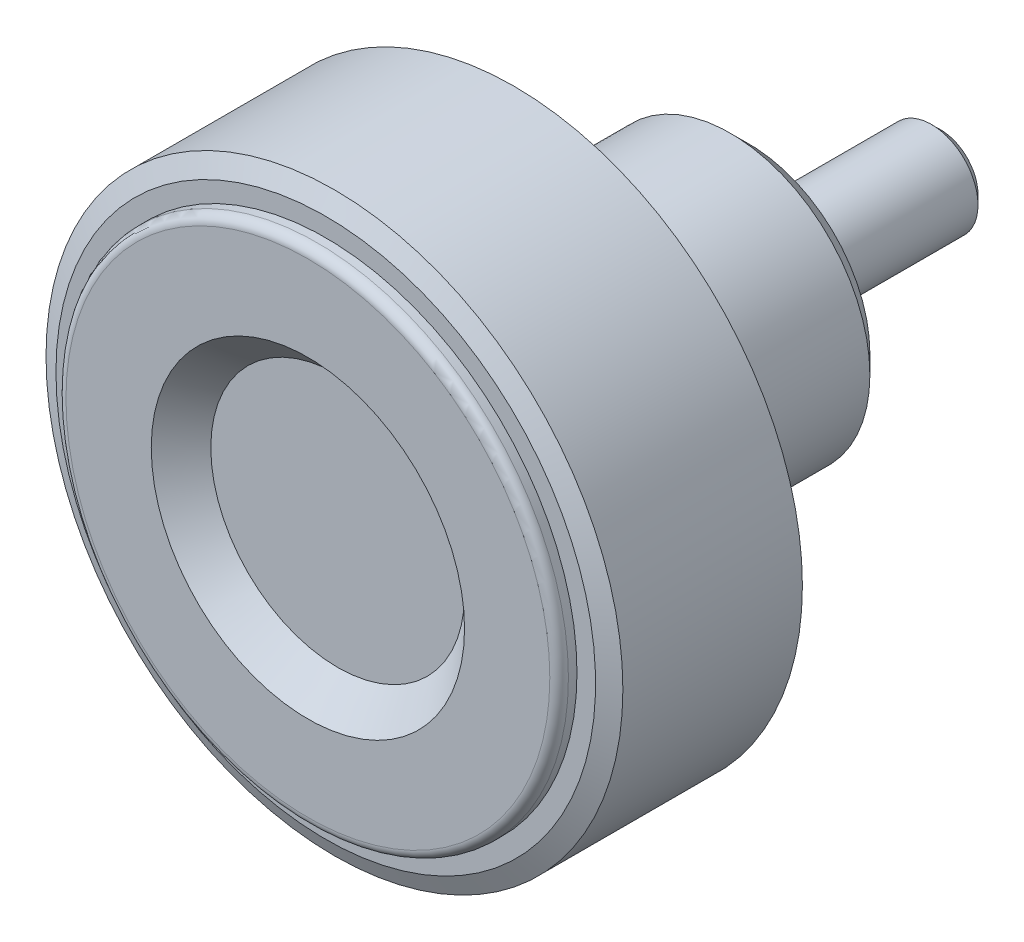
ISO-10303-21;
HEADER;
FILE_DESCRIPTION(('STEP AP214'),'2;1');
FILE_NAME('part.step','',(''),(''),'','','');
FILE_SCHEMA(('AUTOMOTIVE_DESIGN { 1 0 10303 214 1 1 1 1 }'));
ENDSEC;
DATA;
#1=APPLICATION_CONTEXT('core data for automotive mechanical design processes');
#2=APPLICATION_PROTOCOL_DEFINITION('international standard','automotive_design',2000,#1);
#3=PRODUCT_CONTEXT('',#1,'mechanical');
#4=PRODUCT('Part','Part','',(#3));
#5=PRODUCT_RELATED_PRODUCT_CATEGORY('part','',(#4));
#6=PRODUCT_DEFINITION_FORMATION('','',#4);
#7=PRODUCT_DEFINITION_CONTEXT('part definition',#1,'design');
#8=PRODUCT_DEFINITION('design','',#6,#7);
#9=PRODUCT_DEFINITION_SHAPE('','',#8);
#10=(LENGTH_UNIT() NAMED_UNIT(*) SI_UNIT(.MILLI.,.METRE.));
#11=(NAMED_UNIT(*) PLANE_ANGLE_UNIT() SI_UNIT($,.RADIAN.));
#12=(NAMED_UNIT(*) SI_UNIT($,.STERADIAN.) SOLID_ANGLE_UNIT());
#13=UNCERTAINTY_MEASURE_WITH_UNIT(LENGTH_MEASURE(1.E-05),#10,'distance_accuracy_value','');
#14=(GEOMETRIC_REPRESENTATION_CONTEXT(3) GLOBAL_UNCERTAINTY_ASSIGNED_CONTEXT((#13)) GLOBAL_UNIT_ASSIGNED_CONTEXT((#10,
#11,#12)) REPRESENTATION_CONTEXT('',''));
#15=CARTESIAN_POINT('',(0.,0.,0.));
#16=DIRECTION('',(0.,0.,1.));
#17=DIRECTION('',(1.,0.,0.));
#18=AXIS2_PLACEMENT_3D('',#15,#16,#17);
#19=CARTESIAN_POINT('',(0.,0.,0.));
#20=DIRECTION('',(0.,0.,-1.));
#21=DIRECTION('',(-1.,0.,0.));
#22=AXIS2_PLACEMENT_3D('',#19,#20,#21);
#23=CYLINDRICAL_SURFACE('',#22,15.5);
#24=CARTESIAN_POINT('',(0.,0.,22.573692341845));
#25=DIRECTION('',(0.,0.,-1.));
#26=DIRECTION('',(-1.,0.,0.));
#27=AXIS2_PLACEMENT_3D('',#24,#25,#26);
#28=CIRCLE('',#27,15.5);
#29=CARTESIAN_POINT('',(-15.5,0.,22.573692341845));
#30=VERTEX_POINT('',#29);
#31=EDGE_CURVE('E164',#30,#30,#28,.T.);
#32=ORIENTED_EDGE('',*,*,#31,.T.);
#33=EDGE_LOOP('',(#32));
#34=FACE_BOUND('',#33,.T.);
#35=CARTESIAN_POINT('',(0.,0.,12.926307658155));
#36=DIRECTION('',(0.,0.,1.));
#37=DIRECTION('',(0.,1.,0.));
#38=AXIS2_PLACEMENT_3D('',#35,#36,#37);
#39=CIRCLE('',#38,15.5);
#40=CARTESIAN_POINT('',(0.,15.5,12.926307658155));
#41=VERTEX_POINT('',#40);
#42=EDGE_CURVE('E160',#41,#41,#39,.F.);
#43=ORIENTED_EDGE('',*,*,#42,.F.);
#44=EDGE_LOOP('',(#43));
#45=FACE_BOUND('',#44,.T.);
#46=ADVANCED_FACE('F14',(#34,#45),#23,.T.);
#47=CARTESIAN_POINT('',(0.,0.,12.926307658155));
#48=DIRECTION('',(0.,0.,1.));
#49=DIRECTION('',(1.,0.,0.));
#50=AXIS2_PLACEMENT_3D('',#47,#48,#49);
#51=CONICAL_SURFACE('',#50,15.5,1.13446401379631);
#52=CARTESIAN_POINT('',(0.,0.,12.46));
#53=DIRECTION('',(0.,0.,1.));
#54=DIRECTION('',(1.,0.,0.));
#55=AXIS2_PLACEMENT_3D('',#52,#53,#54);
#56=CIRCLE('',#55,14.5);
#57=CARTESIAN_POINT('',(14.5,0.,12.46));
#58=VERTEX_POINT('',#57);
#59=EDGE_CURVE('E157',#58,#58,#56,.F.);
#60=ORIENTED_EDGE('',*,*,#59,.F.);
#61=EDGE_LOOP('',(#60));
#62=FACE_BOUND('',#61,.T.);
#63=ORIENTED_EDGE('',*,*,#42,.T.);
#64=EDGE_LOOP('',(#63));
#65=FACE_BOUND('',#64,.T.);
#66=ADVANCED_FACE('F457',(#62,#65),#51,.T.);
#67=CARTESIAN_POINT('',(0.,14.,12.46));
#68=DIRECTION('',(0.,0.,-1.));
#69=DIRECTION('',(-1.,0.,0.));
#70=AXIS2_PLACEMENT_3D('',#67,#68,#69);
#71=PLANE('',#70);
#72=ORIENTED_EDGE('',*,*,#59,.T.);
#73=EDGE_LOOP('',(#72));
#74=FACE_BOUND('',#73,.T.);
#75=CARTESIAN_POINT('',(0.,0.,12.46));
#76=DIRECTION('',(0.,0.,1.));
#77=DIRECTION('',(1.,0.,0.));
#78=AXIS2_PLACEMENT_3D('',#75,#76,#77);
#79=CIRCLE('',#78,13.5);
#80=CARTESIAN_POINT('',(13.5,0.,12.46));
#81=VERTEX_POINT('',#80);
#82=EDGE_CURVE('E154',#81,#81,#79,.F.);
#83=ORIENTED_EDGE('',*,*,#82,.F.);
#84=EDGE_LOOP('',(#83));
#85=FACE_BOUND('',#84,.T.);
#86=ADVANCED_FACE('F453',(#74,#85),#71,.T.);
#87=CARTESIAN_POINT('',(0.,1.00475,-10.));
#88=DIRECTION('',(0.,0.,-1.));
#89=DIRECTION('',(-1.,0.,0.));
#90=AXIS2_PLACEMENT_3D('',#87,#88,#89);
#91=PLANE('',#90);
#92=CARTESIAN_POINT('',(0.,0.,-10.0000000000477));
#93=DIRECTION('',(0.,0.,1.));
#94=DIRECTION('',(1.,0.,0.));
#95=AXIS2_PLACEMENT_3D('',#92,#93,#94);
#96=CIRCLE('',#95,2.00949999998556);
#97=CARTESIAN_POINT('',(2.00949999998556,0.,-10.0000000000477));
#98=VERTEX_POINT('',#97);
#99=EDGE_CURVE('E150',#98,#98,#96,.T.);
#100=ORIENTED_EDGE('',*,*,#99,.F.);
#101=EDGE_LOOP('',(#100));
#102=FACE_BOUND('',#101,.T.);
#103=ADVANCED_FACE('F449',(#102),#91,.T.);
#104=CARTESIAN_POINT('',(0.,0.,12.23));
#105=DIRECTION('',(0.,0.,1.));
#106=DIRECTION('',(1.,0.,0.));
#107=AXIS2_PLACEMENT_3D('',#104,#105,#106);
#108=CYLINDRICAL_SURFACE('',#107,13.5);
#109=ORIENTED_EDGE('',*,*,#82,.T.);
#110=EDGE_LOOP('',(#109));
#111=FACE_BOUND('',#110,.T.);
#112=CARTESIAN_POINT('',(0.,0.,12.));
#113=DIRECTION('',(0.,0.,-1.));
#114=DIRECTION('',(-1.,0.,0.));
#115=AXIS2_PLACEMENT_3D('',#112,#113,#114);
#116=CIRCLE('',#115,13.5);
#117=CARTESIAN_POINT('',(-13.5,0.,12.));
#118=VERTEX_POINT('',#117);
#119=EDGE_CURVE('E153',#118,#118,#116,.T.);
#120=ORIENTED_EDGE('',*,*,#119,.F.);
#121=EDGE_LOOP('',(#120));
#122=FACE_BOUND('',#121,.T.);
#123=ADVANCED_FACE('F416',(#111,#122),#108,.T.);
#124=CARTESIAN_POINT('',(0.,0.,-9.50950000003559));
#125=DIRECTION('',(0.,0.,1.));
#126=DIRECTION('',(1.,0.,0.));
#127=AXIS2_PLACEMENT_3D('',#124,#125,#126);
#128=CONICAL_SURFACE('',#127,2.50000000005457,0.785398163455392);
#129=ORIENTED_EDGE('',*,*,#99,.T.);
#130=EDGE_LOOP('',(#129));
#131=FACE_BOUND('',#130,.T.);
#132=CARTESIAN_POINT('',(0.,0.,-9.5095));
#133=DIRECTION('',(0.,0.,1.));
#134=DIRECTION('',(1.,0.,0.));
#135=AXIS2_PLACEMENT_3D('',#132,#133,#134);
#136=CIRCLE('',#135,2.5);
#137=CARTESIAN_POINT('',(2.5,0.,-9.5095));
#138=VERTEX_POINT('',#137);
#139=EDGE_CURVE('E343',#138,#138,#136,.T.);
#140=ORIENTED_EDGE('',*,*,#139,.F.);
#141=EDGE_LOOP('',(#140));
#142=FACE_BOUND('',#141,.T.);
#143=ADVANCED_FACE('F410',(#131,#142),#128,.T.);
#144=CARTESIAN_POINT('',(0.,0.,12.));
#145=DIRECTION('',(0.,0.,-1.));
#146=DIRECTION('',(-1.,0.,0.));
#147=AXIS2_PLACEMENT_3D('',#144,#145,#146);
#148=TOROIDAL_SURFACE('',#147,13.,0.5);
#149=ORIENTED_EDGE('',*,*,#119,.T.);
#150=EDGE_LOOP('',(#149));
#151=FACE_BOUND('',#150,.T.);
#152=CARTESIAN_POINT('',(0.,0.,11.5));
#153=DIRECTION('',(0.,0.,1.));
#154=DIRECTION('',(1.,0.,0.));
#155=AXIS2_PLACEMENT_3D('',#152,#153,#154);
#156=CIRCLE('',#155,13.);
#157=CARTESIAN_POINT('',(0.,13.,11.5));
#158=VERTEX_POINT('',#157);
#159=CARTESIAN_POINT('',(13.,0.,11.5));
#160=VERTEX_POINT('',#159);
#161=EDGE_CURVE('E306',#158,#160,#156,.F.);
#162=ORIENTED_EDGE('',*,*,#161,.F.);
#163=CARTESIAN_POINT('',(0.,0.,11.5));
#164=DIRECTION('',(0.,0.,1.));
#165=DIRECTION('',(0.,1.,0.));
#166=AXIS2_PLACEMENT_3D('',#163,#164,#165);
#167=CIRCLE('',#166,13.);
#168=CARTESIAN_POINT('',(-13.,0.,11.5));
#169=VERTEX_POINT('',#168);
#170=EDGE_CURVE('E149',#169,#158,#167,.F.);
#171=ORIENTED_EDGE('',*,*,#170,.F.);
#172=CARTESIAN_POINT('',(0.,0.,11.5));
#173=DIRECTION('',(0.,0.,1.));
#174=DIRECTION('',(-1.,0.,0.));
#175=AXIS2_PLACEMENT_3D('',#172,#173,#174);
#176=CIRCLE('',#175,13.);
#177=EDGE_CURVE('E340',#160,#169,#176,.F.);
#178=ORIENTED_EDGE('',*,*,#177,.F.);
#179=EDGE_LOOP('',(#162,#171,#178));
#180=FACE_BOUND('',#179,.T.);
#181=ADVANCED_FACE('F405',(#151,#180),#148,.T.);
#182=CARTESIAN_POINT('',(0.,0.,-4.25475));
#183=DIRECTION('',(0.,0.,1.));
#184=DIRECTION('',(1.,0.,0.));
#185=AXIS2_PLACEMENT_3D('',#182,#183,#184);
#186=CYLINDRICAL_SURFACE('',#185,2.5);
#187=ORIENTED_EDGE('',*,*,#139,.T.);
#188=EDGE_LOOP('',(#187));
#189=FACE_BOUND('',#188,.T.);
#190=CARTESIAN_POINT('',(0.,0.,0.));
#191=DIRECTION('',(0.,0.,1.));
#192=DIRECTION('',(1.,0.,0.));
#193=AXIS2_PLACEMENT_3D('',#190,#191,#192);
#194=CIRCLE('',#193,2.5);
#195=CARTESIAN_POINT('',(2.5,0.,0.));
#196=VERTEX_POINT('',#195);
#197=EDGE_CURVE('E146',#196,#196,#194,.T.);
#198=ORIENTED_EDGE('',*,*,#197,.F.);
#199=EDGE_LOOP('',(#198));
#200=FACE_BOUND('',#199,.T.);
#201=ADVANCED_FACE('F323',(#189,#200),#186,.T.);
#202=CARTESIAN_POINT('',(0.,12.4615384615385,11.5));
#203=DIRECTION('',(0.,0.,-1.));
#204=DIRECTION('',(-1.,0.,0.));
#205=AXIS2_PLACEMENT_3D('',#202,#203,#204);
#206=PLANE('',#205);
#207=ORIENTED_EDGE('',*,*,#177,.T.);
#208=ORIENTED_EDGE('',*,*,#170,.T.);
#209=ORIENTED_EDGE('',*,*,#161,.T.);
#210=EDGE_LOOP('',(#207,#208,#209));
#211=FACE_BOUND('',#210,.T.);
#212=CARTESIAN_POINT('',(0.,0.,11.5));
#213=DIRECTION('',(0.,0.,1.));
#214=DIRECTION('',(1.,0.,0.));
#215=AXIS2_PLACEMENT_3D('',#212,#213,#214);
#216=CIRCLE('',#215,11.9230769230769);
#217=CARTESIAN_POINT('',(11.9230769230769,0.,11.5));
#218=VERTEX_POINT('',#217);
#219=EDGE_CURVE('E143',#218,#218,#216,.T.);
#220=ORIENTED_EDGE('',*,*,#219,.T.);
#221=EDGE_LOOP('',(#220));
#222=FACE_BOUND('',#221,.T.);
#223=ADVANCED_FACE('F312',(#211,#222),#206,.T.);
#224=CARTESIAN_POINT('',(0.,1.66666666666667,0.));
#225=DIRECTION('',(0.,0.,-1.));
#226=DIRECTION('',(-1.,0.,0.));
#227=AXIS2_PLACEMENT_3D('',#224,#225,#226);
#228=PLANE('',#227);
#229=CARTESIAN_POINT('',(0.,0.,0.));
#230=DIRECTION('',(0.,0.,1.));
#231=DIRECTION('',(1.,0.,0.));
#232=AXIS2_PLACEMENT_3D('',#229,#230,#231);
#233=CIRCLE('',#232,3.33333333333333);
#234=CARTESIAN_POINT('',(3.33333333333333,0.,0.));
#235=VERTEX_POINT('',#234);
#236=EDGE_CURVE('E140',#235,#235,#233,.T.);
#237=ORIENTED_EDGE('',*,*,#236,.F.);
#238=EDGE_LOOP('',(#237));
#239=FACE_BOUND('',#238,.T.);
#240=ORIENTED_EDGE('',*,*,#197,.T.);
#241=EDGE_LOOP('',(#240));
#242=FACE_BOUND('',#241,.T.);
#243=ADVANCED_FACE('F322',(#239,#242),#228,.T.);
#244=CARTESIAN_POINT('',(0.,0.,15.25));
#245=DIRECTION('',(0.,0.,1.));
#246=DIRECTION('',(1.,0.,0.));
#247=AXIS2_PLACEMENT_3D('',#244,#245,#246);
#248=CYLINDRICAL_SURFACE('',#247,11.9230769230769);
#249=CARTESIAN_POINT('',(0.,0.,19.));
#250=DIRECTION('',(0.,0.,-1.));
#251=DIRECTION('',(-1.,0.,0.));
#252=AXIS2_PLACEMENT_3D('',#249,#250,#251);
#253=CIRCLE('',#252,11.9230769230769);
#254=CARTESIAN_POINT('',(-11.9230769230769,0.,19.));
#255=VERTEX_POINT('',#254);
#256=EDGE_CURVE('E139',#255,#255,#253,.F.);
#257=ORIENTED_EDGE('',*,*,#256,.T.);
#258=EDGE_LOOP('',(#257));
#259=FACE_BOUND('',#258,.T.);
#260=ORIENTED_EDGE('',*,*,#219,.F.);
#261=EDGE_LOOP('',(#260));
#262=FACE_BOUND('',#261,.T.);
#263=ADVANCED_FACE('F391',(#259,#262),#248,.F.);
#264=CARTESIAN_POINT('',(0.,0.,0.15));
#265=DIRECTION('',(0.,0.,1.));
#266=DIRECTION('',(1.,0.,0.));
#267=AXIS2_PLACEMENT_3D('',#264,#265,#266);
#268=CYLINDRICAL_SURFACE('',#267,3.33333333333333);
#269=ORIENTED_EDGE('',*,*,#236,.T.);
#270=EDGE_LOOP('',(#269));
#271=FACE_BOUND('',#270,.T.);
#272=CARTESIAN_POINT('',(0.,0.,0.3));
#273=DIRECTION('',(0.,0.,1.));
#274=DIRECTION('',(1.,0.,0.));
#275=AXIS2_PLACEMENT_3D('',#272,#273,#274);
#276=CIRCLE('',#275,3.33333333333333);
#277=CARTESIAN_POINT('',(3.33333333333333,0.,0.3));
#278=VERTEX_POINT('',#277);
#279=EDGE_CURVE('E135',#278,#278,#276,.T.);
#280=ORIENTED_EDGE('',*,*,#279,.F.);
#281=EDGE_LOOP('',(#280));
#282=FACE_BOUND('',#281,.T.);
#283=ADVANCED_FACE('F282',(#271,#282),#268,.T.);
#284=CARTESIAN_POINT('',(0.,0.,19.));
#285=DIRECTION('',(0.,0.,-1.));
#286=DIRECTION('',(-1.,0.,0.));
#287=AXIS2_PLACEMENT_3D('',#284,#285,#286);
#288=TOROIDAL_SURFACE('',#287,10.9230769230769,1.);
#289=CARTESIAN_POINT('',(0.,0.,20.));
#290=DIRECTION('',(0.,0.,1.));
#291=DIRECTION('',(0.,1.,0.));
#292=AXIS2_PLACEMENT_3D('',#289,#290,#291);
#293=CIRCLE('',#292,10.9230769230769);
#294=CARTESIAN_POINT('',(-10.9230769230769,0.,20.));
#295=VERTEX_POINT('',#294);
#296=CARTESIAN_POINT('',(0.,10.9230769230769,20.));
#297=VERTEX_POINT('',#296);
#298=EDGE_CURVE('E134',#295,#297,#293,.F.);
#299=ORIENTED_EDGE('',*,*,#298,.F.);
#300=CARTESIAN_POINT('',(0.,0.,20.));
#301=DIRECTION('',(0.,0.,1.));
#302=DIRECTION('',(-1.,0.,0.));
#303=AXIS2_PLACEMENT_3D('',#300,#301,#302);
#304=CIRCLE('',#303,10.9230769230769);
#305=CARTESIAN_POINT('',(10.9230769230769,0.,20.));
#306=VERTEX_POINT('',#305);
#307=EDGE_CURVE('E656',#306,#295,#304,.F.);
#308=ORIENTED_EDGE('',*,*,#307,.F.);
#309=CARTESIAN_POINT('',(0.,0.,20.));
#310=DIRECTION('',(0.,0.,1.));
#311=DIRECTION('',(1.,0.,0.));
#312=AXIS2_PLACEMENT_3D('',#309,#310,#311);
#313=CIRCLE('',#312,10.9230769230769);
#314=EDGE_CURVE('E138',#297,#306,#313,.F.);
#315=ORIENTED_EDGE('',*,*,#314,.F.);
#316=EDGE_LOOP('',(#299,#308,#315));
#317=FACE_BOUND('',#316,.T.);
#318=ORIENTED_EDGE('',*,*,#256,.F.);
#319=EDGE_LOOP('',(#318));
#320=FACE_BOUND('',#319,.T.);
#321=ADVANCED_FACE('F278',(#317,#320),#288,.F.);
#322=CARTESIAN_POINT('',(0.,4.91666666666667,0.3));
#323=DIRECTION('',(0.,0.,-1.));
#324=DIRECTION('',(-1.,0.,0.));
#325=AXIS2_PLACEMENT_3D('',#322,#323,#324);
#326=PLANE('',#325);
#327=CARTESIAN_POINT('',(0.,0.,0.3));
#328=DIRECTION('',(0.,0.,1.));
#329=DIRECTION('',(1.,0.,0.));
#330=AXIS2_PLACEMENT_3D('',#327,#328,#329);
#331=CIRCLE('',#330,6.5);
#332=CARTESIAN_POINT('',(6.5,0.,0.3));
#333=VERTEX_POINT('',#332);
#334=EDGE_CURVE('E125',#333,#333,#331,.T.);
#335=ORIENTED_EDGE('',*,*,#334,.F.);
#336=EDGE_LOOP('',(#335));
#337=FACE_BOUND('',#336,.T.);
#338=ORIENTED_EDGE('',*,*,#279,.T.);
#339=EDGE_LOOP('',(#338));
#340=FACE_BOUND('',#339,.T.);
#341=ADVANCED_FACE('F216',(#337,#340),#326,.T.);
#342=CARTESIAN_POINT('',(0.,9.71153846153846,20.));
#343=DIRECTION('',(0.,0.,-1.));
#344=DIRECTION('',(-1.,0.,0.));
#345=AXIS2_PLACEMENT_3D('',#342,#343,#344);
#346=PLANE('',#345);
#347=ORIENTED_EDGE('',*,*,#307,.T.);
#348=ORIENTED_EDGE('',*,*,#298,.T.);
#349=ORIENTED_EDGE('',*,*,#314,.T.);
#350=EDGE_LOOP('',(#347,#348,#349));
#351=FACE_BOUND('',#350,.T.);
#352=CARTESIAN_POINT('',(0.,0.,20.));
#353=DIRECTION('',(0.,0.,-1.));
#354=DIRECTION('',(-1.,0.,0.));
#355=AXIS2_PLACEMENT_3D('',#352,#353,#354);
#356=CIRCLE('',#355,8.5);
#357=CARTESIAN_POINT('',(0.,8.5,20.));
#358=VERTEX_POINT('',#357);
#359=CARTESIAN_POINT('',(-8.5,0.,20.));
#360=VERTEX_POINT('',#359);
#361=EDGE_CURVE('E33',#358,#360,#356,.F.);
#362=ORIENTED_EDGE('',*,*,#361,.T.);
#363=CARTESIAN_POINT('',(0.,0.,20.));
#364=DIRECTION('',(0.,0.,-1.));
#365=DIRECTION('',(1.,0.,0.));
#366=AXIS2_PLACEMENT_3D('',#363,#364,#365);
#367=CIRCLE('',#366,8.5);
#368=CARTESIAN_POINT('',(8.5,0.,20.));
#369=VERTEX_POINT('',#368);
#370=EDGE_CURVE('E133',#360,#369,#367,.F.);
#371=ORIENTED_EDGE('',*,*,#370,.T.);
#372=CARTESIAN_POINT('',(0.,0.,20.));
#373=DIRECTION('',(0.,0.,-1.));
#374=DIRECTION('',(0.,1.,0.));
#375=AXIS2_PLACEMENT_3D('',#372,#373,#374);
#376=CIRCLE('',#375,8.5);
#377=EDGE_CURVE('E203',#369,#358,#376,.F.);
#378=ORIENTED_EDGE('',*,*,#377,.T.);
#379=EDGE_LOOP('',(#362,#371,#378));
#380=FACE_BOUND('',#379,.T.);
#381=ADVANCED_FACE('F207',(#351,#380),#346,.T.);
#382=CARTESIAN_POINT('',(0.,0.,1.3));
#383=DIRECTION('',(0.,0.,1.));
#384=DIRECTION('',(1.,0.,0.));
#385=AXIS2_PLACEMENT_3D('',#382,#383,#384);
#386=CONICAL_SURFACE('',#385,7.5,0.785398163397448);
#387=ORIENTED_EDGE('',*,*,#334,.T.);
#388=EDGE_LOOP('',(#387));
#389=FACE_BOUND('',#388,.T.);
#390=CARTESIAN_POINT('',(0.,0.,1.3));
#391=DIRECTION('',(0.,0.,1.));
#392=DIRECTION('',(1.,0.,0.));
#393=AXIS2_PLACEMENT_3D('',#390,#391,#392);
#394=CIRCLE('',#393,7.5);
#395=CARTESIAN_POINT('',(7.5,0.,1.3));
#396=VERTEX_POINT('',#395);
#397=EDGE_CURVE('E24',#396,#396,#394,.T.);
#398=ORIENTED_EDGE('',*,*,#397,.F.);
#399=EDGE_LOOP('',(#398));
#400=FACE_BOUND('',#399,.T.);
#401=ADVANCED_FACE('F194',(#389,#400),#386,.T.);
#402=CARTESIAN_POINT('',(0.,0.,19.));
#403=DIRECTION('',(0.,0.,-1.));
#404=DIRECTION('',(-1.,0.,0.));
#405=AXIS2_PLACEMENT_3D('',#402,#403,#404);
#406=TOROIDAL_SURFACE('',#405,8.5,1.);
#407=CARTESIAN_POINT('',(0.,0.,19.));
#408=DIRECTION('',(0.,0.,1.));
#409=DIRECTION('',(1.,0.,0.));
#410=AXIS2_PLACEMENT_3D('',#407,#408,#409);
#411=CIRCLE('',#410,7.5);
#412=CARTESIAN_POINT('',(7.5,0.,19.));
#413=VERTEX_POINT('',#412);
#414=EDGE_CURVE('E9',#413,#413,#411,.F.);
#415=ORIENTED_EDGE('',*,*,#414,.F.);
#416=EDGE_LOOP('',(#415));
#417=FACE_BOUND('',#416,.T.);
#418=ORIENTED_EDGE('',*,*,#370,.F.);
#419=ORIENTED_EDGE('',*,*,#361,.F.);
#420=ORIENTED_EDGE('',*,*,#377,.F.);
#421=EDGE_LOOP('',(#418,#419,#420));
#422=FACE_BOUND('',#421,.T.);
#423=ADVANCED_FACE('F182',(#417,#422),#406,.F.);
#424=CARTESIAN_POINT('',(0.,0.,10.15));
#425=DIRECTION('',(0.,0.,1.));
#426=DIRECTION('',(1.,0.,0.));
#427=AXIS2_PLACEMENT_3D('',#424,#425,#426);
#428=CYLINDRICAL_SURFACE('',#427,7.5);
#429=ORIENTED_EDGE('',*,*,#397,.T.);
#430=EDGE_LOOP('',(#429));
#431=FACE_BOUND('',#430,.T.);
#432=ORIENTED_EDGE('',*,*,#414,.T.);
#433=EDGE_LOOP('',(#432));
#434=FACE_BOUND('',#433,.T.);
#435=ADVANCED_FACE('F193',(#431,#434),#428,.T.);
#436=CARTESIAN_POINT('',(0.,3.40909090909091,22.4));
#437=DIRECTION('',(0.,0.,1.));
#438=DIRECTION('',(1.,0.,0.));
#439=AXIS2_PLACEMENT_3D('',#436,#437,#438);
#440=PLANE('',#439);
#441=CARTESIAN_POINT('',(0.,0.,22.4));
#442=DIRECTION('',(0.,0.,1.));
#443=DIRECTION('',(1.,0.,0.));
#444=AXIS2_PLACEMENT_3D('',#441,#442,#443);
#445=CIRCLE('',#444,6.81818181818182);
#446=CARTESIAN_POINT('',(6.81818181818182,0.,22.4));
#447=VERTEX_POINT('',#446);
#448=EDGE_CURVE('E171',#447,#447,#445,.T.);
#449=ORIENTED_EDGE('',*,*,#448,.T.);
#450=EDGE_LOOP('',(#449));
#451=FACE_BOUND('',#450,.T.);
#452=ADVANCED_FACE('F16',(#451),#440,.T.);
#453=CARTESIAN_POINT('',(0.,0.,24.));
#454=DIRECTION('',(0.,0.,1.));
#455=DIRECTION('',(1.,0.,0.));
#456=AXIS2_PLACEMENT_3D('',#453,#454,#455);
#457=CONICAL_SURFACE('',#456,8.41818181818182,0.785398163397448);
#458=CARTESIAN_POINT('',(0.,0.,24.));
#459=DIRECTION('',(0.,0.,1.));
#460=DIRECTION('',(1.,0.,0.));
#461=AXIS2_PLACEMENT_3D('',#458,#459,#460);
#462=CIRCLE('',#461,8.41818181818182);
#463=CARTESIAN_POINT('',(8.41818181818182,0.,24.));
#464=VERTEX_POINT('',#463);
#465=EDGE_CURVE('E77',#464,#464,#462,.F.);
#466=ORIENTED_EDGE('',*,*,#465,.F.);
#467=EDGE_LOOP('',(#466));
#468=FACE_BOUND('',#467,.T.);
#469=ORIENTED_EDGE('',*,*,#448,.F.);
#470=EDGE_LOOP('',(#469));
#471=FACE_BOUND('',#470,.T.);
#472=ADVANCED_FACE('F99',(#468,#471),#457,.F.);
#473=CARTESIAN_POINT('',(0.,10.7090909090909,24.));
#474=DIRECTION('',(0.,0.,1.));
#475=DIRECTION('',(1.,0.,0.));
#476=AXIS2_PLACEMENT_3D('',#473,#474,#475);
#477=PLANE('',#476);
#478=ORIENTED_EDGE('',*,*,#465,.T.);
#479=EDGE_LOOP('',(#478));
#480=FACE_BOUND('',#479,.T.);
#481=CARTESIAN_POINT('',(0.,0.,24.));
#482=DIRECTION('',(0.,0.,-1.));
#483=DIRECTION('',(-1.,0.,0.));
#484=AXIS2_PLACEMENT_3D('',#481,#482,#483);
#485=CIRCLE('',#484,13.);
#486=CARTESIAN_POINT('',(-13.,0.,24.));
#487=VERTEX_POINT('',#486);
#488=CARTESIAN_POINT('',(0.,13.,24.));
#489=VERTEX_POINT('',#488);
#490=EDGE_CURVE('E71',#487,#489,#485,.T.);
#491=ORIENTED_EDGE('',*,*,#490,.F.);
#492=CARTESIAN_POINT('',(0.,0.,24.));
#493=DIRECTION('',(0.,0.,-1.));
#494=DIRECTION('',(1.,0.,0.));
#495=AXIS2_PLACEMENT_3D('',#492,#493,#494);
#496=CIRCLE('',#495,13.);
#497=CARTESIAN_POINT('',(13.,0.,24.));
#498=VERTEX_POINT('',#497);
#499=EDGE_CURVE('E66',#498,#487,#496,.T.);
#500=ORIENTED_EDGE('',*,*,#499,.F.);
#501=CARTESIAN_POINT('',(0.,0.,24.));
#502=DIRECTION('',(0.,0.,-1.));
#503=DIRECTION('',(0.,1.,0.));
#504=AXIS2_PLACEMENT_3D('',#501,#502,#503);
#505=CIRCLE('',#504,13.);
#506=EDGE_CURVE('E73',#489,#498,#505,.T.);
#507=ORIENTED_EDGE('',*,*,#506,.F.);
#508=EDGE_LOOP('',(#491,#500,#507));
#509=FACE_BOUND('',#508,.T.);
#510=ADVANCED_FACE('F81',(#480,#509),#477,.T.);
#511=CARTESIAN_POINT('',(0.,0.,23.5));
#512=DIRECTION('',(0.,0.,-1.));
#513=DIRECTION('',(-1.,0.,0.));
#514=AXIS2_PLACEMENT_3D('',#511,#512,#513);
#515=TOROIDAL_SURFACE('',#514,13.,0.5);
#516=ORIENTED_EDGE('',*,*,#499,.T.);
#517=ORIENTED_EDGE('',*,*,#490,.T.);
#518=ORIENTED_EDGE('',*,*,#506,.T.);
#519=EDGE_LOOP('',(#516,#517,#518));
#520=FACE_BOUND('',#519,.T.);
#521=CARTESIAN_POINT('',(0.,0.,23.5));
#522=DIRECTION('',(0.,0.,1.));
#523=DIRECTION('',(1.,0.,0.));
#524=AXIS2_PLACEMENT_3D('',#521,#522,#523);
#525=CIRCLE('',#524,13.5);
#526=CARTESIAN_POINT('',(13.5,0.,23.5));
#527=VERTEX_POINT('',#526);
#528=EDGE_CURVE('E168',#527,#527,#525,.F.);
#529=ORIENTED_EDGE('',*,*,#528,.F.);
#530=EDGE_LOOP('',(#529));
#531=FACE_BOUND('',#530,.T.);
#532=ADVANCED_FACE('F69',(#520,#531),#515,.T.);
#533=CARTESIAN_POINT('',(0.,0.,23.27));
#534=DIRECTION('',(0.,0.,1.));
#535=DIRECTION('',(1.,0.,0.));
#536=AXIS2_PLACEMENT_3D('',#533,#534,#535);
#537=CYLINDRICAL_SURFACE('',#536,13.5);
#538=CARTESIAN_POINT('',(0.,0.,23.04));
#539=DIRECTION('',(0.,0.,1.));
#540=DIRECTION('',(1.,0.,0.));
#541=AXIS2_PLACEMENT_3D('',#538,#539,#540);
#542=CIRCLE('',#541,13.5);
#543=CARTESIAN_POINT('',(13.5,0.,23.04));
#544=VERTEX_POINT('',#543);
#545=EDGE_CURVE('E165',#544,#544,#542,.F.);
#546=ORIENTED_EDGE('',*,*,#545,.F.);
#547=EDGE_LOOP('',(#546));
#548=FACE_BOUND('',#547,.T.);
#549=ORIENTED_EDGE('',*,*,#528,.T.);
#550=EDGE_LOOP('',(#549));
#551=FACE_BOUND('',#550,.T.);
#552=ADVANCED_FACE('F359',(#548,#551),#537,.T.);
#553=CARTESIAN_POINT('',(0.,0.,22.573692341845));
#554=DIRECTION('',(0.,0.,-1.));
#555=DIRECTION('',(-1.,0.,0.));
#556=AXIS2_PLACEMENT_3D('',#553,#554,#555);
#557=CONICAL_SURFACE('',#556,15.5,1.13446401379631);
#558=ORIENTED_EDGE('',*,*,#31,.F.);
#559=EDGE_LOOP('',(#558));
#560=FACE_BOUND('',#559,.T.);
#561=CARTESIAN_POINT('',(0.,0.,23.04));
#562=DIRECTION('',(0.,0.,-1.));
#563=DIRECTION('',(-1.,0.,0.));
#564=AXIS2_PLACEMENT_3D('',#561,#562,#563);
#565=CIRCLE('',#564,14.5);
#566=CARTESIAN_POINT('',(-14.5,0.,23.04));
#567=VERTEX_POINT('',#566);
#568=EDGE_CURVE('E161',#567,#567,#565,.T.);
#569=ORIENTED_EDGE('',*,*,#568,.T.);
#570=EDGE_LOOP('',(#569));
#571=FACE_BOUND('',#570,.T.);
#572=ADVANCED_FACE('F366',(#560,#571),#557,.T.);
#573=CARTESIAN_POINT('',(0.,14.,23.04));
#574=DIRECTION('',(0.,0.,1.));
#575=DIRECTION('',(1.,0.,0.));
#576=AXIS2_PLACEMENT_3D('',#573,#574,#575);
#577=PLANE('',#576);
#578=ORIENTED_EDGE('',*,*,#545,.T.);
#579=EDGE_LOOP('',(#578));
#580=FACE_BOUND('',#579,.T.);
#581=ORIENTED_EDGE('',*,*,#568,.F.);
#582=EDGE_LOOP('',(#581));
#583=FACE_BOUND('',#582,.T.);
#584=ADVANCED_FACE('F467',(#580,#583),#577,.T.);
#585=CLOSED_SHELL('',(#46,#66,#86,#103,#123,#143,#181,#201,#223,#243,#263,#283,#321,#341,#381,
#401,#423,#435,#452,#472,#510,#532,#552,#572,#584));
#586=MANIFOLD_SOLID_BREP('B1',#585);
#587=ADVANCED_BREP_SHAPE_REPRESENTATION('',(#18,#586),#14);
#588=SHAPE_DEFINITION_REPRESENTATION(#9,#587);
ENDSEC;
END-ISO-10303-21;
